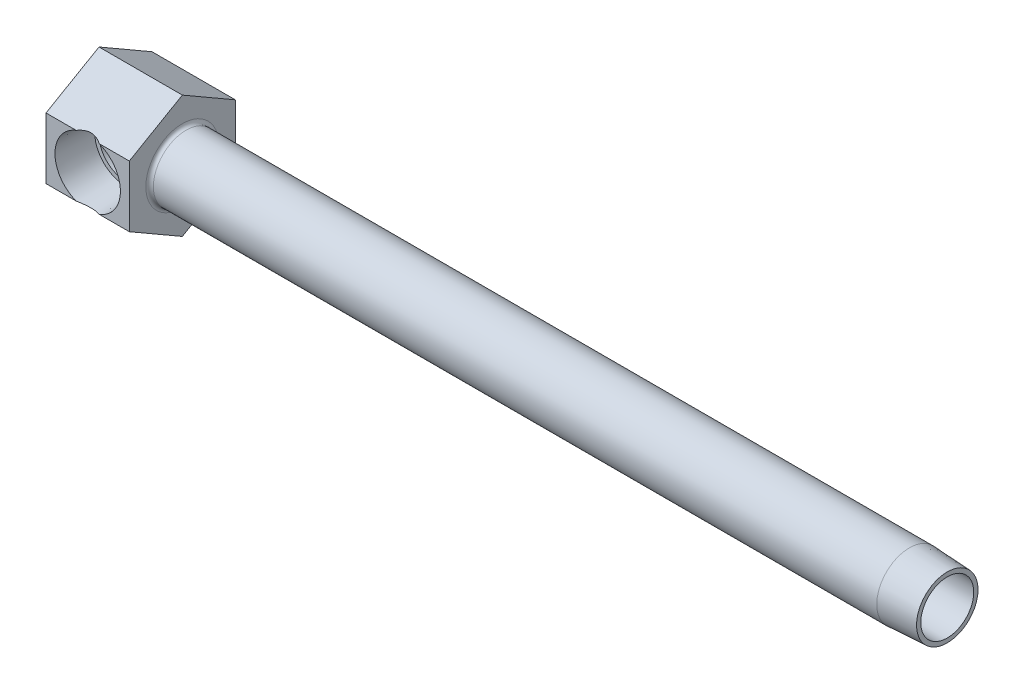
ISO-10303-21;
HEADER;
FILE_DESCRIPTION(('STEP AP214'),'2;1');
FILE_NAME('part.step','',(''),(''),'','','');
FILE_SCHEMA(('AUTOMOTIVE_DESIGN { 1 0 10303 214 1 1 1 1 }'));
ENDSEC;
DATA;
#1=APPLICATION_CONTEXT('core data for automotive mechanical design processes');
#2=APPLICATION_PROTOCOL_DEFINITION('international standard','automotive_design',2000,#1);
#3=PRODUCT_CONTEXT('',#1,'mechanical');
#4=PRODUCT('Part','Part','',(#3));
#5=PRODUCT_RELATED_PRODUCT_CATEGORY('part','',(#4));
#6=PRODUCT_DEFINITION_FORMATION('','',#4);
#7=PRODUCT_DEFINITION_CONTEXT('part definition',#1,'design');
#8=PRODUCT_DEFINITION('design','',#6,#7);
#9=PRODUCT_DEFINITION_SHAPE('','',#8);
#10=(LENGTH_UNIT() NAMED_UNIT(*) SI_UNIT(.MILLI.,.METRE.));
#11=(NAMED_UNIT(*) PLANE_ANGLE_UNIT() SI_UNIT($,.RADIAN.));
#12=(NAMED_UNIT(*) SI_UNIT($,.STERADIAN.) SOLID_ANGLE_UNIT());
#13=UNCERTAINTY_MEASURE_WITH_UNIT(LENGTH_MEASURE(1.E-05),#10,'distance_accuracy_value','');
#14=(GEOMETRIC_REPRESENTATION_CONTEXT(3) GLOBAL_UNCERTAINTY_ASSIGNED_CONTEXT((#13)) GLOBAL_UNIT_ASSIGNED_CONTEXT((#10,
#11,#12)) REPRESENTATION_CONTEXT('',''));
#15=CARTESIAN_POINT('',(0.,0.,0.));
#16=DIRECTION('',(0.,0.,1.));
#17=DIRECTION('',(1.,0.,0.));
#18=AXIS2_PLACEMENT_3D('',#15,#16,#17);
#19=CARTESIAN_POINT('',(63.5,0.,11.1125));
#20=DIRECTION('',(-1.,0.,0.));
#21=DIRECTION('',(0.,0.,1.));
#22=AXIS2_PLACEMENT_3D('',#19,#20,#21);
#23=CYLINDRICAL_SURFACE('',#22,6.858);
#24=CARTESIAN_POINT('',(18.2499,0.,11.1125));
#25=DIRECTION('',(-1.,0.,0.));
#26=DIRECTION('',(0.,-1.,0.));
#27=AXIS2_PLACEMENT_3D('',#24,#25,#26);
#28=CIRCLE('',#27,6.858);
#29=CARTESIAN_POINT('',(18.2499,-6.858,11.1125));
#30=VERTEX_POINT('',#29);
#31=EDGE_CURVE('E22',#30,#30,#28,.F.);
#32=ORIENTED_EDGE('',*,*,#31,.T.);
#33=EDGE_LOOP('',(#32));
#34=FACE_BOUND('',#33,.T.);
#35=CARTESIAN_POINT('',(169.8752,0.,11.1125));
#36=DIRECTION('',(1.,0.,0.));
#37=DIRECTION('',(0.,0.,-1.));
#38=AXIS2_PLACEMENT_3D('',#35,#36,#37);
#39=CIRCLE('',#38,6.858);
#40=CARTESIAN_POINT('',(169.8752,0.,4.2545));
#41=VERTEX_POINT('',#40);
#42=EDGE_CURVE('E156',#41,#41,#39,.T.);
#43=ORIENTED_EDGE('',*,*,#42,.F.);
#44=EDGE_LOOP('',(#43));
#45=FACE_BOUND('',#44,.T.);
#46=ADVANCED_FACE('F15',(#34,#45),#23,.T.);
#47=CARTESIAN_POINT('',(8.7376,0.,22.225));
#48=DIRECTION('',(0.,0.,1.));
#49=DIRECTION('',(1.,0.,0.));
#50=AXIS2_PLACEMENT_3D('',#47,#48,#49);
#51=CONICAL_SURFACE('',#50,6.858,0.0523598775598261);
#52=CARTESIAN_POINT('',(8.7376,-0.680996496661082,34.5170205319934));
#53=DIRECTION('',(0.,-0.866025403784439,-0.5));
#54=DIRECTION('',(0.,-0.5,0.866025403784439));
#55=AXIS2_PLACEMENT_3D('',#52,#53,#54);
#56=ELLIPSE('',#55,15.0043949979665,7.47122554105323);
#57=CARTESIAN_POINT('',(11.1603281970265,6.4158048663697,22.225));
#58=VERTEX_POINT('',#57);
#59=CARTESIAN_POINT('',(6.3148718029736,6.4158048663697,22.225));
#60=VERTEX_POINT('',#59);
#61=EDGE_CURVE('E232',#58,#60,#56,.F.);
#62=ORIENTED_EDGE('',*,*,#61,.T.);
#63=CARTESIAN_POINT('',(8.7376,0.,22.225));
#64=DIRECTION('',(0.,0.,-1.));
#65=DIRECTION('',(-1.,0.,0.));
#66=AXIS2_PLACEMENT_3D('',#63,#64,#65);
#67=CIRCLE('',#66,6.858);
#68=CARTESIAN_POINT('',(6.31487180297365,-6.41580486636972,22.225));
#69=VERTEX_POINT('',#68);
#70=EDGE_CURVE('E36',#69,#60,#67,.T.);
#71=ORIENTED_EDGE('',*,*,#70,.F.);
#72=CARTESIAN_POINT('',(8.7376,0.680996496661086,34.5170205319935));
#73=DIRECTION('',(0.,0.866025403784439,-0.5));
#74=DIRECTION('',(0.,0.5,0.866025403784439));
#75=AXIS2_PLACEMENT_3D('',#72,#73,#74);
#76=ELLIPSE('',#75,15.0043949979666,7.47122554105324);
#77=CARTESIAN_POINT('',(11.1603281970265,-6.4158048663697,22.225));
#78=VERTEX_POINT('',#77);
#79=EDGE_CURVE('E10',#69,#78,#76,.F.);
#80=ORIENTED_EDGE('',*,*,#79,.T.);
#81=EDGE_CURVE('E249',#58,#78,#67,.T.);
#82=ORIENTED_EDGE('',*,*,#81,.F.);
#83=EDGE_LOOP('',(#62,#71,#80,#82));
#84=FACE_BOUND('',#83,.T.);
#85=CARTESIAN_POINT('',(8.7376,0.,14.3002));
#86=DIRECTION('',(0.,0.,-1.));
#87=DIRECTION('',(-1.,0.,0.));
#88=AXIS2_PLACEMENT_3D('',#85,#86,#87);
#89=CIRCLE('',#88,6.44267883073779);
#90=CARTESIAN_POINT('',(13.3057672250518,-4.54312213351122,14.3002));
#91=VERTEX_POINT('',#90);
#92=CARTESIAN_POINT('',(13.3057672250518,4.54312213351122,14.3002));
#93=VERTEX_POINT('',#92);
#94=EDGE_CURVE('E251',#91,#93,#89,.T.);
#95=ORIENTED_EDGE('',*,*,#94,.T.);
#96=CARTESIAN_POINT('',(13.3056128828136,4.54326245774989,14.3));
#97=CARTESIAN_POINT('',(13.4050037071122,4.45290836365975,14.4287190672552));
#98=CARTESIAN_POINT('',(13.5038252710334,4.35690222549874,14.5539811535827));
#99=CARTESIAN_POINT('',(13.6989301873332,4.15324987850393,14.7972290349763));
#100=CARTESIAN_POINT('',(13.7952093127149,4.04558563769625,14.9152031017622));
#101=CARTESIAN_POINT('',(13.9843700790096,3.81752411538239,15.1441485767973));
#102=CARTESIAN_POINT('',(14.0772125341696,3.69701926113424,15.25504596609));
#103=CARTESIAN_POINT('',(14.2568464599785,3.44414434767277,15.4675620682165));
#104=CARTESIAN_POINT('',(14.3436418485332,3.31178210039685,15.5691868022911));
#105=CARTESIAN_POINT('',(14.5527686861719,2.962976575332,15.8122617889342));
#106=CARTESIAN_POINT('',(14.6701286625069,2.73858307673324,15.9469651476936));
#107=CARTESIAN_POINT('',(14.8276174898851,2.38307262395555,16.1264780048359));
#108=CARTESIAN_POINT('',(14.8769849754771,2.2615363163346,16.1825173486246));
#109=CARTESIAN_POINT('',(14.9687772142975,2.0125151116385,16.2864098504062));
#110=CARTESIAN_POINT('',(15.0112056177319,1.88503338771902,16.3342673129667));
#111=CARTESIAN_POINT('',(15.088733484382,1.6232487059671,16.4215218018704));
#112=CARTESIAN_POINT('',(15.1237419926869,1.48888366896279,16.4608139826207));
#113=CARTESIAN_POINT('',(15.1849785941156,1.21573970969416,16.5294343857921));
#114=CARTESIAN_POINT('',(15.2112114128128,1.0769632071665,16.5587679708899));
#115=CARTESIAN_POINT('',(15.2542466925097,0.796159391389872,16.6068431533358));
#116=CARTESIAN_POINT('',(15.2710505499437,0.654132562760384,16.6255863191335));
#117=CARTESIAN_POINT('',(15.2947665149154,0.368243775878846,16.6520290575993));
#118=CARTESIAN_POINT('',(15.3016803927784,0.22438215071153,16.6597306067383));
#119=CARTESIAN_POINT('',(15.3051381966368,-0.0413792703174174,16.6635827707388));
#120=CARTESIAN_POINT('',(15.3031178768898,-0.163241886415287,16.6613326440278));
#121=CARTESIAN_POINT('',(15.2919140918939,-0.406265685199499,16.6488476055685));
#122=CARTESIAN_POINT('',(15.282728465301,-0.527426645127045,16.6386102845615));
#123=CARTESIAN_POINT('',(15.2573805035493,-0.768029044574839,16.6103343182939));
#124=CARTESIAN_POINT('',(15.2412218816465,-0.88747136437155,16.5922998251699));
#125=CARTESIAN_POINT('',(15.2022471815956,-1.1238947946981,16.5487418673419));
#126=CARTESIAN_POINT('',(15.1794285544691,-1.24087494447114,16.5232155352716));
#127=CARTESIAN_POINT('',(15.1030013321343,-1.58064044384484,16.4375716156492));
#128=CARTESIAN_POINT('',(15.0406598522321,-1.79907617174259,16.3675454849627));
#129=CARTESIAN_POINT('',(14.8959772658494,-2.2198653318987,16.2041288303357));
#130=CARTESIAN_POINT('',(14.8136249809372,-2.42220969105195,16.1107252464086));
#131=CARTESIAN_POINT('',(14.6581620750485,-2.75475802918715,15.9330467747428));
#132=CARTESIAN_POINT('',(14.588877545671,-2.88934500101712,15.8534887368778));
#133=CARTESIAN_POINT('',(14.4433958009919,-3.14876465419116,15.6853070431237));
#134=CARTESIAN_POINT('',(14.3671982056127,-3.27359679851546,15.5966828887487));
#135=CARTESIAN_POINT('',(14.2091096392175,-3.51355050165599,15.4112660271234));
#136=CARTESIAN_POINT('',(14.1272094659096,-3.62865566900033,15.3144600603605));
#137=CARTESIAN_POINT('',(13.9591121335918,-3.84892561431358,15.1136697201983));
#138=CARTESIAN_POINT('',(13.8729164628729,-3.95409379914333,15.0096878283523));
#139=CARTESIAN_POINT('',(13.7069469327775,-4.14374167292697,14.806812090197));
#140=CARTESIAN_POINT('',(13.62749258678,-4.22922772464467,14.7085925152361));
#141=CARTESIAN_POINT('',(13.4673498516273,-4.39212627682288,14.5076746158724));
#142=CARTESIAN_POINT('',(13.386669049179,-4.46957495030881,14.404999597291));
#143=CARTESIAN_POINT('',(13.3056128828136,-4.54326245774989,14.3));
#144=B_SPLINE_CURVE_WITH_KNOTS('',3,(#96,#97,#98,#99,#100,#101,#102,#103,#104,#105,#106,#107,
#108,#109,#110,#111,#112,#113,#114,#115,#116,#117,#118,#119,#120,#121,#122,#123,#124,#125,#126,
#127,#128,#129,#130,#131,#132,#133,#134,#135,#136,#137,#138,#139,#140,#141,#142,#143),
.UNSPECIFIED.,.F.,.F.,(4,2,2,2,2,2,2,2,2,2,2,2,2,2,2,2,2,2,2,2,2,2,2,4),(0.,0.55807217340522,
1.11702021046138,1.68108674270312,2.24478434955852,3.10140634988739,3.52893103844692,
3.95623010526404,4.38849766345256,4.82053207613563,5.25250248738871,5.68439556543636,
6.04963287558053,6.41498039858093,6.78013360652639,7.14542675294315,7.85550743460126,
8.56598569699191,9.07835413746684,9.59075076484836,10.1039943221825,10.6170612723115,
11.0743952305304,11.5295724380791),.UNSPECIFIED.);
#145=EDGE_CURVE('E130',#93,#91,#144,.T.);
#146=ORIENTED_EDGE('',*,*,#145,.T.);
#147=EDGE_LOOP('',(#95,#146));
#148=FACE_BOUND('',#147,.T.);
#149=ADVANCED_FACE('F138',(#84,#148),#51,.F.);
#150=CARTESIAN_POINT('',(15.1802788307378,0.,14.3002));
#151=DIRECTION('',(0.,0.,1.));
#152=DIRECTION('',(1.,0.,0.));
#153=AXIS2_PLACEMENT_3D('',#150,#151,#152);
#154=PLANE('',#153);
#155=ORIENTED_EDGE('',*,*,#94,.F.);
#156=DIRECTION('',(1.,0.,0.));
#157=VECTOR('',#156,1.);
#158=CARTESIAN_POINT('',(65.6255637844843,-4.54312213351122,14.3002));
#159=LINE('',#158,#157);
#160=CARTESIAN_POINT('',(11.9253,-4.54312213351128,14.3002));
#161=VERTEX_POINT('',#160);
#162=EDGE_CURVE('E128',#91,#161,#159,.F.);
#163=ORIENTED_EDGE('',*,*,#162,.T.);
#164=CARTESIAN_POINT('',(8.7376,0.,14.3002));
#165=DIRECTION('',(0.,0.,-1.));
#166=DIRECTION('',(-1.,0.,0.));
#167=AXIS2_PLACEMENT_3D('',#164,#165,#166);
#168=CIRCLE('',#167,5.5499);
#169=CARTESIAN_POINT('',(11.9253,4.54312213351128,14.3002));
#170=VERTEX_POINT('',#169);
#171=EDGE_CURVE('E120',#161,#170,#168,.T.);
#172=ORIENTED_EDGE('',*,*,#171,.T.);
#173=DIRECTION('',(1.,0.,0.));
#174=VECTOR('',#173,1.);
#175=CARTESIAN_POINT('',(65.6255637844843,4.54312213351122,14.3002));
#176=LINE('',#175,#174);
#177=EDGE_CURVE('E123',#170,#93,#176,.T.);
#178=ORIENTED_EDGE('',*,*,#177,.T.);
#179=EDGE_LOOP('',(#155,#163,#172,#178));
#180=FACE_BOUND('',#179,.T.);
#181=ADVANCED_FACE('F181',(#180),#154,.T.);
#182=CARTESIAN_POINT('',(8.7376,0.,27.6280516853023));
#183=DIRECTION('',(0.,0.,-1.));
#184=DIRECTION('',(-1.,0.,0.));
#185=AXIS2_PLACEMENT_3D('',#182,#183,#184);
#186=CYLINDRICAL_SURFACE('',#185,5.5499);
#187=ORIENTED_EDGE('',*,*,#171,.F.);
#188=CARTESIAN_POINT('',(8.7376,0.,11.1125));
#189=DIRECTION('',(0.707106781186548,0.,-0.707106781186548));
#190=DIRECTION('',(-0.707106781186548,0.,-0.707106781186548));
#191=AXIS2_PLACEMENT_3D('',#188,#189,#190);
#192=ELLIPSE('',#191,7.84874384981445,5.5499);
#193=CARTESIAN_POINT('',(8.7376,-5.5499,11.1125));
#194=VERTEX_POINT('',#193);
#195=EDGE_CURVE('E109',#161,#194,#192,.T.);
#196=ORIENTED_EDGE('',*,*,#195,.T.);
#197=CARTESIAN_POINT('',(8.7376,0.,11.1125));
#198=DIRECTION('',(-0.707106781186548,0.,-0.707106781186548));
#199=DIRECTION('',(0.707106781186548,0.,-0.707106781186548));
#200=AXIS2_PLACEMENT_3D('',#197,#198,#199);
#201=ELLIPSE('',#200,7.84874384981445,5.5499);
#202=CARTESIAN_POINT('',(13.4708637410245,-2.89786203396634,6.37923625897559));
#203=VERTEX_POINT('',#202);
#204=EDGE_CURVE('E104',#194,#203,#201,.F.);
#205=ORIENTED_EDGE('',*,*,#204,.T.);
#206=CARTESIAN_POINT('',(8.7376,0.,6.37923625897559));
#207=DIRECTION('',(0.,0.,-1.));
#208=DIRECTION('',(-1.,0.,0.));
#209=AXIS2_PLACEMENT_3D('',#206,#207,#208);
#210=CIRCLE('',#209,5.5499);
#211=CARTESIAN_POINT('',(13.4708637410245,2.89786203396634,6.37923625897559));
#212=VERTEX_POINT('',#211);
#213=EDGE_CURVE('E136',#203,#212,#210,.T.);
#214=ORIENTED_EDGE('',*,*,#213,.T.);
#215=CARTESIAN_POINT('',(8.7376,5.5499,11.1125));
#216=VERTEX_POINT('',#215);
#217=EDGE_CURVE('E29',#212,#216,#201,.F.);
#218=ORIENTED_EDGE('',*,*,#217,.T.);
#219=EDGE_CURVE('E121',#216,#170,#192,.T.);
#220=ORIENTED_EDGE('',*,*,#219,.T.);
#221=EDGE_LOOP('',(#187,#196,#205,#214,#218,#220));
#222=FACE_BOUND('',#221,.T.);
#223=ADVANCED_FACE('F117',(#222),#186,.F.);
#224=CARTESIAN_POINT('',(8.7376,0.,6.37923625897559));
#225=DIRECTION('',(0.,0.,1.));
#226=DIRECTION('',(1.,0.,0.));
#227=AXIS2_PLACEMENT_3D('',#224,#225,#226);
#228=CONICAL_SURFACE('',#227,5.5499,1.04719755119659);
#229=CARTESIAN_POINT('',(8.7376,0.,3.175));
#230=VERTEX_POINT('',#229);
#231=VERTEX_LOOP('',#230);
#232=FACE_BOUND('',#231,.T.);
#233=ORIENTED_EDGE('',*,*,#213,.F.);
#234=CARTESIAN_POINT('',(13.4710699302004,-2.89818868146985,6.37943625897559));
#235=CARTESIAN_POINT('',(13.420685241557,-2.8185279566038,6.33063423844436));
#236=CARTESIAN_POINT('',(13.3737513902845,-2.73601453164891,6.2828976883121));
#237=CARTESIAN_POINT('',(13.2869939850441,-2.56583570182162,6.19038737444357));
#238=CARTESIAN_POINT('',(13.2471660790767,-2.47817349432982,6.14561180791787));
#239=CARTESIAN_POINT('',(13.1751547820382,-2.29911606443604,6.06025322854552));
#240=CARTESIAN_POINT('',(13.1428940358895,-2.20777091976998,6.01963042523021));
#241=CARTESIAN_POINT('',(13.0851463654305,-2.02119544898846,5.94274790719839));
#242=CARTESIAN_POINT('',(13.0596596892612,-1.92596498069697,5.90648835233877));
#243=CARTESIAN_POINT('',(13.0148514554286,-1.73255643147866,5.83897057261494));
#244=CARTESIAN_POINT('',(12.9955185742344,-1.63438413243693,5.80770321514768));
#245=CARTESIAN_POINT('',(12.9620830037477,-1.4356334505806,5.75050007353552));
#246=CARTESIAN_POINT('',(12.9479806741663,-1.33505490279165,5.72456465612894));
#247=CARTESIAN_POINT('',(12.9240526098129,-1.13183172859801,5.67823452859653));
#248=CARTESIAN_POINT('',(12.9142392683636,-1.0291819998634,5.65785593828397));
#249=CARTESIAN_POINT('',(12.8981074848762,-0.822623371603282,5.62290462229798));
#250=CARTESIAN_POINT('',(12.891789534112,-0.718714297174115,5.60833271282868));
#251=CARTESIAN_POINT('',(12.8810293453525,-0.489671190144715,5.58281999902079));
#252=CARTESIAN_POINT('',(12.8771967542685,-0.364365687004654,5.57314917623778));
#253=CARTESIAN_POINT('',(12.8729275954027,-0.113319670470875,5.56233429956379));
#254=CARTESIAN_POINT('',(12.8724915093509,0.0124209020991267,5.56119145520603));
#255=CARTESIAN_POINT('',(12.874939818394,0.263686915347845,5.567443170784));
#256=CARTESIAN_POINT('',(12.8778249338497,0.389212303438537,5.57483958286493));
#257=CARTESIAN_POINT('',(12.8874191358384,0.639322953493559,5.59811647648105));
#258=CARTESIAN_POINT('',(12.8941278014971,0.763908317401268,5.61399602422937));
#259=CARTESIAN_POINT('',(12.9116197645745,1.00072761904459,5.65236645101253));
#260=CARTESIAN_POINT('',(12.9220027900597,1.11310193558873,5.6741708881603));
#261=CARTESIAN_POINT('',(12.9479188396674,1.33574469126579,5.72453194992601));
#262=CARTESIAN_POINT('',(12.9634519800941,1.44601308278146,5.75308872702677));
#263=CARTESIAN_POINT('',(13.00082798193,1.66326683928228,5.81649299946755));
#264=CARTESIAN_POINT('',(13.022650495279,1.77026157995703,5.85132007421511));
#265=CARTESIAN_POINT('',(13.0737132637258,1.98033019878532,5.92673676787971));
#266=CARTESIAN_POINT('',(13.1029503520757,2.08340572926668,5.96732392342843));
#267=CARTESIAN_POINT('',(13.1785970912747,2.31167706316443,6.06504898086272));
#268=CARTESIAN_POINT('',(13.2275080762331,2.43541928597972,6.12371071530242));
#269=CARTESIAN_POINT('',(13.3111431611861,2.61414296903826,6.21635789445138));
#270=CARTESIAN_POINT('',(13.3408272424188,2.67271819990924,6.24810824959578));
#271=CARTESIAN_POINT('',(13.4034989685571,2.78735967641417,6.31288069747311));
#272=CARTESIAN_POINT('',(13.4364871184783,2.8434255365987,6.34590298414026));
#273=CARTESIAN_POINT('',(13.4710699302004,2.89818868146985,6.37943625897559));
#274=B_SPLINE_CURVE_WITH_KNOTS('',3,(#234,#235,#236,#237,#238,#239,#240,#241,#242,#243,#244,
#245,#246,#247,#248,#249,#250,#251,#252,#253,#254,#255,#256,#257,#258,#259,#260,#261,#262,#263,
#264,#265,#266,#267,#268,#269,#270,#271,#272,#273),.UNSPECIFIED.,.F.,.F.,(4,2,2,2,2,2,2,2,2,2,2,
2,2,2,2,2,2,2,2,4),(0.,0.318348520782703,0.636501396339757,0.951244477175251,1.26599908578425,
1.58017112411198,1.89436476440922,2.20946038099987,2.52460027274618,2.90145665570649,
3.27836648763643,3.65535808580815,4.03230819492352,4.37682355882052,4.72134670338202,
5.06476748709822,5.40804184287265,5.84309066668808,6.06180090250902,6.28054461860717),.UNSPECIFIED.);
#275=EDGE_CURVE('E111',#203,#212,#274,.T.);
#276=ORIENTED_EDGE('',*,*,#275,.T.);
#277=EDGE_LOOP('',(#233,#276));
#278=FACE_BOUND('',#277,.T.);
#279=ADVANCED_FACE('F148',(#232,#278),#228,.F.);
#280=CARTESIAN_POINT('',(17.4625,12.8316097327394,11.1125));
#281=DIRECTION('',(0.,-0.866025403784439,-0.5));
#282=DIRECTION('',(0.,0.5,-0.866025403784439));
#283=AXIS2_PLACEMENT_3D('',#280,#281,#282);
#284=PLANE('',#283);
#285=ORIENTED_EDGE('',*,*,#61,.F.);
#286=DIRECTION('',(-1.,0.,0.));
#287=VECTOR('',#286,1.);
#288=CARTESIAN_POINT('',(17.4625,6.4158048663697,22.225));
#289=LINE('',#288,#287);
#290=CARTESIAN_POINT('',(17.4625,6.4158048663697,22.225));
#291=VERTEX_POINT('',#290);
#292=EDGE_CURVE('E202',#291,#58,#289,.T.);
#293=ORIENTED_EDGE('',*,*,#292,.F.);
#294=DIRECTION('',(0.,-0.5,0.866025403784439));
#295=VECTOR('',#294,1.);
#296=CARTESIAN_POINT('',(17.4625,12.8316097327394,11.1125));
#297=LINE('',#296,#295);
#298=CARTESIAN_POINT('',(17.4625,12.8316097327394,11.1125));
#299=VERTEX_POINT('',#298);
#300=EDGE_CURVE('E222',#299,#291,#297,.T.);
#301=ORIENTED_EDGE('',*,*,#300,.F.);
#302=DIRECTION('',(-1.,0.,0.));
#303=VECTOR('',#302,1.);
#304=CARTESIAN_POINT('',(17.4625,12.8316097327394,11.1125));
#305=LINE('',#304,#303);
#306=CARTESIAN_POINT('',(0.,12.8316097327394,11.1125));
#307=VERTEX_POINT('',#306);
#308=EDGE_CURVE('E199',#299,#307,#305,.T.);
#309=ORIENTED_EDGE('',*,*,#308,.T.);
#310=DIRECTION('',(0.,-0.5,0.866025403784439));
#311=VECTOR('',#310,1.);
#312=CARTESIAN_POINT('',(0.,12.8316097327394,11.1125));
#313=LINE('',#312,#311);
#314=CARTESIAN_POINT('',(0.,6.4158048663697,22.225));
#315=VERTEX_POINT('',#314);
#316=EDGE_CURVE('E239',#307,#315,#313,.T.);
#317=ORIENTED_EDGE('',*,*,#316,.T.);
#318=EDGE_CURVE('E205',#60,#315,#289,.T.);
#319=ORIENTED_EDGE('',*,*,#318,.F.);
#320=EDGE_LOOP('',(#285,#293,#301,#309,#317,#319));
#321=FACE_BOUND('',#320,.T.);
#322=ADVANCED_FACE('F256',(#321),#284,.F.);
#323=CARTESIAN_POINT('',(17.4625,6.4158048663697,22.225));
#324=DIRECTION('',(0.,0.,-1.));
#325=DIRECTION('',(0.,1.,0.));
#326=AXIS2_PLACEMENT_3D('',#323,#324,#325);
#327=PLANE('',#326);
#328=ORIENTED_EDGE('',*,*,#70,.T.);
#329=ORIENTED_EDGE('',*,*,#318,.T.);
#330=DIRECTION('',(0.,-1.,0.));
#331=VECTOR('',#330,1.);
#332=CARTESIAN_POINT('',(0.,6.4158048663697,22.225));
#333=LINE('',#332,#331);
#334=CARTESIAN_POINT('',(0.,-6.41580486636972,22.225));
#335=VERTEX_POINT('',#334);
#336=EDGE_CURVE('E235',#315,#335,#333,.T.);
#337=ORIENTED_EDGE('',*,*,#336,.T.);
#338=DIRECTION('',(-1.,0.,0.));
#339=VECTOR('',#338,1.);
#340=CARTESIAN_POINT('',(17.4625,-6.41580486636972,22.225));
#341=LINE('',#340,#339);
#342=EDGE_CURVE('E209',#69,#335,#341,.T.);
#343=ORIENTED_EDGE('',*,*,#342,.F.);
#344=EDGE_LOOP('',(#328,#329,#337,#343));
#345=FACE_BOUND('',#344,.T.);
#346=ADVANCED_FACE('F263',(#345),#327,.F.);
#347=ORIENTED_EDGE('',*,*,#81,.T.);
#348=CARTESIAN_POINT('',(17.4625,-6.41580486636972,22.225));
#349=VERTEX_POINT('',#348);
#350=EDGE_CURVE('E206',#349,#78,#341,.T.);
#351=ORIENTED_EDGE('',*,*,#350,.F.);
#352=DIRECTION('',(0.,-1.,0.));
#353=VECTOR('',#352,1.);
#354=CARTESIAN_POINT('',(17.4625,6.4158048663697,22.225));
#355=LINE('',#354,#353);
#356=EDGE_CURVE('E220',#291,#349,#355,.T.);
#357=ORIENTED_EDGE('',*,*,#356,.F.);
#358=ORIENTED_EDGE('',*,*,#292,.T.);
#359=EDGE_LOOP('',(#347,#351,#357,#358));
#360=FACE_BOUND('',#359,.T.);
#361=ADVANCED_FACE('F287',(#360),#327,.F.);
#362=CARTESIAN_POINT('',(17.4625,-6.41580486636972,22.225));
#363=DIRECTION('',(0.,0.866025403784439,-0.5));
#364=DIRECTION('',(0.,0.5,0.866025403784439));
#365=AXIS2_PLACEMENT_3D('',#362,#363,#364);
#366=PLANE('',#365);
#367=ORIENTED_EDGE('',*,*,#79,.F.);
#368=ORIENTED_EDGE('',*,*,#342,.T.);
#369=DIRECTION('',(0.,-0.5,-0.866025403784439));
#370=VECTOR('',#369,1.);
#371=CARTESIAN_POINT('',(0.,-6.41580486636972,22.225));
#372=LINE('',#371,#370);
#373=CARTESIAN_POINT('',(0.,-12.8316097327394,11.1125));
#374=VERTEX_POINT('',#373);
#375=EDGE_CURVE('E218',#335,#374,#372,.T.);
#376=ORIENTED_EDGE('',*,*,#375,.T.);
#377=DIRECTION('',(-1.,0.,0.));
#378=VECTOR('',#377,1.);
#379=CARTESIAN_POINT('',(17.4625,-12.8316097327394,11.1125));
#380=LINE('',#379,#378);
#381=CARTESIAN_POINT('',(17.4625,-12.8316097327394,11.1125));
#382=VERTEX_POINT('',#381);
#383=EDGE_CURVE('E210',#382,#374,#380,.T.);
#384=ORIENTED_EDGE('',*,*,#383,.F.);
#385=DIRECTION('',(0.,-0.5,-0.866025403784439));
#386=VECTOR('',#385,1.);
#387=CARTESIAN_POINT('',(17.4625,-6.41580486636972,22.225));
#388=LINE('',#387,#386);
#389=EDGE_CURVE('E213',#349,#382,#388,.T.);
#390=ORIENTED_EDGE('',*,*,#389,.F.);
#391=ORIENTED_EDGE('',*,*,#350,.T.);
#392=EDGE_LOOP('',(#367,#368,#376,#384,#390,#391));
#393=FACE_BOUND('',#392,.T.);
#394=ADVANCED_FACE('F283',(#393),#366,.F.);
#395=CARTESIAN_POINT('',(17.4625,-12.8316097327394,11.1125));
#396=DIRECTION('',(0.,0.866025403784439,0.5));
#397=DIRECTION('',(0.,-0.5,0.866025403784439));
#398=AXIS2_PLACEMENT_3D('',#395,#396,#397);
#399=PLANE('',#398);
#400=DIRECTION('',(0.,0.5,-0.866025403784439));
#401=VECTOR('',#400,1.);
#402=CARTESIAN_POINT('',(0.,-12.8316097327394,11.1125));
#403=LINE('',#402,#401);
#404=CARTESIAN_POINT('',(0.,-6.41580486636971,0.));
#405=VERTEX_POINT('',#404);
#406=EDGE_CURVE('E227',#374,#405,#403,.T.);
#407=ORIENTED_EDGE('',*,*,#406,.T.);
#408=DIRECTION('',(-1.,0.,0.));
#409=VECTOR('',#408,1.);
#410=CARTESIAN_POINT('',(17.4625,-6.41580486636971,0.));
#411=LINE('',#410,#409);
#412=CARTESIAN_POINT('',(17.4625,-6.41580486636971,0.));
#413=VERTEX_POINT('',#412);
#414=EDGE_CURVE('E191',#413,#405,#411,.T.);
#415=ORIENTED_EDGE('',*,*,#414,.F.);
#416=DIRECTION('',(0.,0.5,-0.866025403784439));
#417=VECTOR('',#416,1.);
#418=CARTESIAN_POINT('',(17.4625,-12.8316097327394,11.1125));
#419=LINE('',#418,#417);
#420=EDGE_CURVE('E214',#382,#413,#419,.T.);
#421=ORIENTED_EDGE('',*,*,#420,.F.);
#422=ORIENTED_EDGE('',*,*,#383,.T.);
#423=EDGE_LOOP('',(#407,#415,#421,#422));
#424=FACE_BOUND('',#423,.T.);
#425=ADVANCED_FACE('F286',(#424),#399,.F.);
#426=CARTESIAN_POINT('',(17.4625,-6.41580486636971,0.));
#427=DIRECTION('',(0.,0.,1.));
#428=DIRECTION('',(1.,0.,0.));
#429=AXIS2_PLACEMENT_3D('',#426,#427,#428);
#430=PLANE('',#429);
#431=DIRECTION('',(0.,1.,0.));
#432=VECTOR('',#431,1.);
#433=CARTESIAN_POINT('',(0.,-6.41580486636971,0.));
#434=LINE('',#433,#432);
#435=CARTESIAN_POINT('',(0.,6.41580486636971,0.));
#436=VERTEX_POINT('',#435);
#437=EDGE_CURVE('E231',#405,#436,#434,.T.);
#438=ORIENTED_EDGE('',*,*,#437,.T.);
#439=DIRECTION('',(-1.,0.,0.));
#440=VECTOR('',#439,1.);
#441=CARTESIAN_POINT('',(17.4625,6.41580486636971,0.));
#442=LINE('',#441,#440);
#443=CARTESIAN_POINT('',(17.4625,6.41580486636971,0.));
#444=VERTEX_POINT('',#443);
#445=EDGE_CURVE('E196',#444,#436,#442,.T.);
#446=ORIENTED_EDGE('',*,*,#445,.F.);
#447=DIRECTION('',(0.,1.,0.));
#448=VECTOR('',#447,1.);
#449=CARTESIAN_POINT('',(17.4625,-6.41580486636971,0.));
#450=LINE('',#449,#448);
#451=EDGE_CURVE('E217',#413,#444,#450,.T.);
#452=ORIENTED_EDGE('',*,*,#451,.F.);
#453=ORIENTED_EDGE('',*,*,#414,.T.);
#454=EDGE_LOOP('',(#438,#446,#452,#453));
#455=FACE_BOUND('',#454,.T.);
#456=ADVANCED_FACE('F294',(#455),#430,.F.);
#457=CARTESIAN_POINT('',(17.4625,6.4158048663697,0.));
#458=DIRECTION('',(0.,-0.866025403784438,0.5));
#459=DIRECTION('',(0.,-0.5,-0.866025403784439));
#460=AXIS2_PLACEMENT_3D('',#457,#458,#459);
#461=PLANE('',#460);
#462=DIRECTION('',(0.,0.5,0.866025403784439));
#463=VECTOR('',#462,1.);
#464=CARTESIAN_POINT('',(0.,6.4158048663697,0.));
#465=LINE('',#464,#463);
#466=EDGE_CURVE('E243',#436,#307,#465,.T.);
#467=ORIENTED_EDGE('',*,*,#466,.T.);
#468=ORIENTED_EDGE('',*,*,#308,.F.);
#469=DIRECTION('',(0.,0.5,0.866025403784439));
#470=VECTOR('',#469,1.);
#471=CARTESIAN_POINT('',(17.4625,6.4158048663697,0.));
#472=LINE('',#471,#470);
#473=EDGE_CURVE('E224',#444,#299,#472,.T.);
#474=ORIENTED_EDGE('',*,*,#473,.F.);
#475=ORIENTED_EDGE('',*,*,#445,.T.);
#476=EDGE_LOOP('',(#467,#468,#474,#475));
#477=FACE_BOUND('',#476,.T.);
#478=ADVANCED_FACE('F281',(#477),#461,.F.);
#479=CARTESIAN_POINT('',(17.4625,-19.2474145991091,22.225));
#480=DIRECTION('',(-1.,0.,0.));
#481=DIRECTION('',(0.,-1.,0.));
#482=AXIS2_PLACEMENT_3D('',#479,#480,#481);
#483=PLANE('',#482);
#484=CARTESIAN_POINT('',(17.4625,0.,11.1125));
#485=DIRECTION('',(-1.,0.,0.));
#486=DIRECTION('',(0.,-1.,0.));
#487=AXIS2_PLACEMENT_3D('',#484,#485,#486);
#488=CIRCLE('',#487,7.6454);
#489=CARTESIAN_POINT('',(17.4625,-7.6454,11.1125));
#490=VERTEX_POINT('',#489);
#491=EDGE_CURVE('E189',#490,#490,#488,.T.);
#492=ORIENTED_EDGE('',*,*,#491,.T.);
#493=EDGE_LOOP('',(#492));
#494=FACE_BOUND('',#493,.T.);
#495=ORIENTED_EDGE('',*,*,#420,.T.);
#496=ORIENTED_EDGE('',*,*,#451,.T.);
#497=ORIENTED_EDGE('',*,*,#473,.T.);
#498=ORIENTED_EDGE('',*,*,#300,.T.);
#499=ORIENTED_EDGE('',*,*,#356,.T.);
#500=ORIENTED_EDGE('',*,*,#389,.T.);
#501=EDGE_LOOP('',(#495,#496,#497,#498,#499,#500));
#502=FACE_BOUND('',#501,.T.);
#503=ADVANCED_FACE('F277',(#494,#502),#483,.F.);
#504=CARTESIAN_POINT('',(0.,-19.2474145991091,22.225));
#505=DIRECTION('',(-1.,0.,0.));
#506=DIRECTION('',(0.,-1.,0.));
#507=AXIS2_PLACEMENT_3D('',#504,#505,#506);
#508=PLANE('',#507);
#509=ORIENTED_EDGE('',*,*,#406,.F.);
#510=ORIENTED_EDGE('',*,*,#375,.F.);
#511=ORIENTED_EDGE('',*,*,#336,.F.);
#512=ORIENTED_EDGE('',*,*,#316,.F.);
#513=ORIENTED_EDGE('',*,*,#466,.F.);
#514=ORIENTED_EDGE('',*,*,#437,.F.);
#515=EDGE_LOOP('',(#509,#510,#511,#512,#513,#514));
#516=FACE_BOUND('',#515,.T.);
#517=ADVANCED_FACE('F274',(#516),#508,.T.);
#518=CARTESIAN_POINT('',(18.2499,0.,11.1125));
#519=DIRECTION('',(-1.,0.,0.));
#520=DIRECTION('',(0.,-1.,0.));
#521=AXIS2_PLACEMENT_3D('',#518,#519,#520);
#522=TOROIDAL_SURFACE('',#521,7.6454,0.7874);
#523=ORIENTED_EDGE('',*,*,#31,.F.);
#524=EDGE_LOOP('',(#523));
#525=FACE_BOUND('',#524,.T.);
#526=ORIENTED_EDGE('',*,*,#491,.F.);
#527=EDGE_LOOP('',(#526));
#528=FACE_BOUND('',#527,.T.);
#529=ADVANCED_FACE('F146',(#525,#528),#522,.F.);
#530=CARTESIAN_POINT('',(65.6255637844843,0.,11.1125));
#531=DIRECTION('',(1.,0.,0.));
#532=DIRECTION('',(0.,0.,-1.));
#533=AXIS2_PLACEMENT_3D('',#530,#531,#532);
#534=CYLINDRICAL_SURFACE('',#533,5.5499);
#535=ORIENTED_EDGE('',*,*,#177,.F.);
#536=ORIENTED_EDGE('',*,*,#219,.F.);
#537=ORIENTED_EDGE('',*,*,#217,.F.);
#538=ORIENTED_EDGE('',*,*,#275,.F.);
#539=ORIENTED_EDGE('',*,*,#204,.F.);
#540=ORIENTED_EDGE('',*,*,#195,.F.);
#541=ORIENTED_EDGE('',*,*,#162,.F.);
#542=ORIENTED_EDGE('',*,*,#145,.F.);
#543=EDGE_LOOP('',(#535,#536,#537,#538,#539,#540,#541,#542));
#544=FACE_BOUND('',#543,.T.);
#545=CARTESIAN_POINT('',(177.8,0.,11.1125));
#546=DIRECTION('',(1.,0.,0.));
#547=DIRECTION('',(0.,0.,-1.));
#548=AXIS2_PLACEMENT_3D('',#545,#546,#547);
#549=CIRCLE('',#548,5.5499);
#550=CARTESIAN_POINT('',(177.8,0.,5.5626));
#551=VERTEX_POINT('',#550);
#552=EDGE_CURVE('E162',#551,#551,#549,.T.);
#553=ORIENTED_EDGE('',*,*,#552,.T.);
#554=EDGE_LOOP('',(#553));
#555=FACE_BOUND('',#554,.T.);
#556=ADVANCED_FACE('F106',(#544,#555),#534,.F.);
#557=CARTESIAN_POINT('',(177.8,0.,11.1125));
#558=DIRECTION('',(-1.,0.,0.));
#559=DIRECTION('',(0.,0.,1.));
#560=AXIS2_PLACEMENT_3D('',#557,#558,#559);
#561=CONICAL_SURFACE('',#560,6.44267883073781,0.052359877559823);
#562=ORIENTED_EDGE('',*,*,#42,.T.);
#563=EDGE_LOOP('',(#562));
#564=FACE_BOUND('',#563,.T.);
#565=CARTESIAN_POINT('',(177.8,0.,11.1125));
#566=DIRECTION('',(1.,0.,0.));
#567=DIRECTION('',(0.,0.,-1.));
#568=AXIS2_PLACEMENT_3D('',#565,#566,#567);
#569=CIRCLE('',#568,6.44267883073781);
#570=CARTESIAN_POINT('',(177.8,0.,4.66982116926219));
#571=VERTEX_POINT('',#570);
#572=EDGE_CURVE('E159',#571,#571,#569,.T.);
#573=ORIENTED_EDGE('',*,*,#572,.F.);
#574=EDGE_LOOP('',(#573));
#575=FACE_BOUND('',#574,.T.);
#576=ADVANCED_FACE('F145',(#564,#575),#561,.T.);
#577=CARTESIAN_POINT('',(177.8,0.,5.5626));
#578=DIRECTION('',(1.,0.,0.));
#579=DIRECTION('',(0.,0.,-1.));
#580=AXIS2_PLACEMENT_3D('',#577,#578,#579);
#581=PLANE('',#580);
#582=ORIENTED_EDGE('',*,*,#572,.T.);
#583=EDGE_LOOP('',(#582));
#584=FACE_BOUND('',#583,.T.);
#585=ORIENTED_EDGE('',*,*,#552,.F.);
#586=EDGE_LOOP('',(#585));
#587=FACE_BOUND('',#586,.T.);
#588=ADVANCED_FACE('F166',(#584,#587),#581,.T.);
#589=CLOSED_SHELL('',(#46,#149,#181,#223,#279,#322,#346,#361,#394,#425,#456,#478,#503,#517,#529,
#556,#576,#588));
#590=MANIFOLD_SOLID_BREP('B1',#589);
#591=ADVANCED_BREP_SHAPE_REPRESENTATION('',(#18,#590),#14);
#592=SHAPE_DEFINITION_REPRESENTATION(#9,#591);
ENDSEC;
END-ISO-10303-21;
